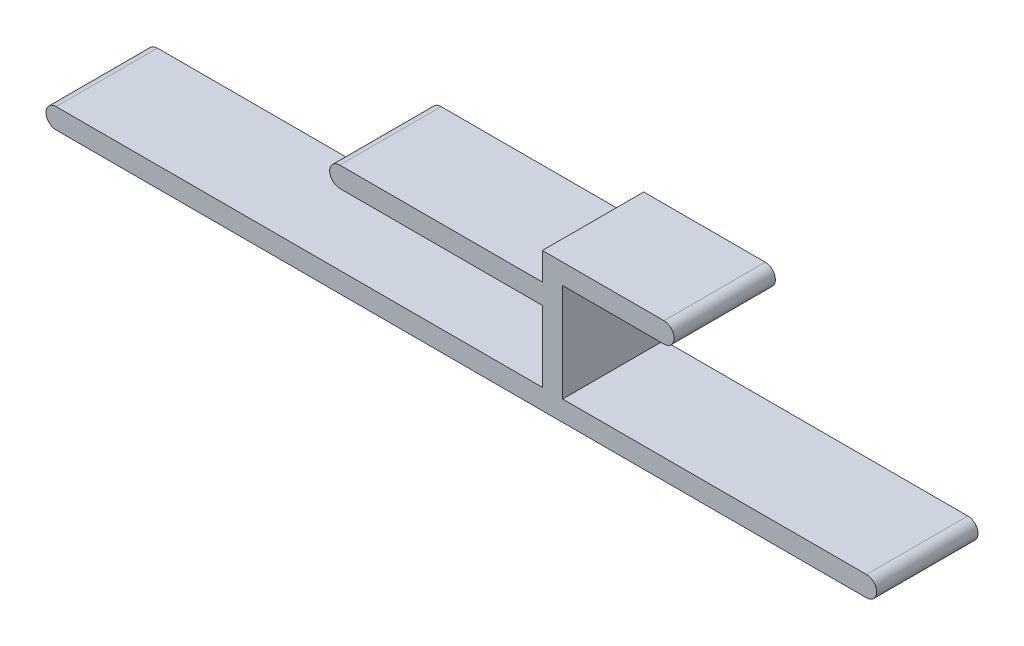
ISO-10303-21;
HEADER;
FILE_DESCRIPTION(('STEP AP214'),'2;1');
FILE_NAME('part.step','',(''),(''),'','','');
FILE_SCHEMA(('AUTOMOTIVE_DESIGN { 1 0 10303 214 1 1 1 1 }'));
ENDSEC;
DATA;
#1=APPLICATION_CONTEXT('core data for automotive mechanical design processes');
#2=APPLICATION_PROTOCOL_DEFINITION('international standard','automotive_design',2000,#1);
#3=PRODUCT_CONTEXT('',#1,'mechanical');
#4=PRODUCT('Part','Part','',(#3));
#5=PRODUCT_RELATED_PRODUCT_CATEGORY('part','',(#4));
#6=PRODUCT_DEFINITION_FORMATION('','',#4);
#7=PRODUCT_DEFINITION_CONTEXT('part definition',#1,'design');
#8=PRODUCT_DEFINITION('design','',#6,#7);
#9=PRODUCT_DEFINITION_SHAPE('','',#8);
#10=(LENGTH_UNIT() NAMED_UNIT(*) SI_UNIT(.MILLI.,.METRE.));
#11=(NAMED_UNIT(*) PLANE_ANGLE_UNIT() SI_UNIT($,.RADIAN.));
#12=(NAMED_UNIT(*) SI_UNIT($,.STERADIAN.) SOLID_ANGLE_UNIT());
#13=UNCERTAINTY_MEASURE_WITH_UNIT(LENGTH_MEASURE(1.E-05),#10,'distance_accuracy_value','');
#14=(GEOMETRIC_REPRESENTATION_CONTEXT(3) GLOBAL_UNCERTAINTY_ASSIGNED_CONTEXT((#13)) GLOBAL_UNIT_ASSIGNED_CONTEXT((#10,
#11,#12)) REPRESENTATION_CONTEXT('',''));
#15=CARTESIAN_POINT('',(0.,0.,0.));
#16=DIRECTION('',(0.,0.,1.));
#17=DIRECTION('',(1.,0.,0.));
#18=AXIS2_PLACEMENT_3D('',#15,#16,#17);
#19=CARTESIAN_POINT('',(-50.,-1.,10.));
#20=DIRECTION('',(0.,0.,-1.));
#21=DIRECTION('',(-1.,0.,0.));
#22=AXIS2_PLACEMENT_3D('',#19,#20,#21);
#23=CYLINDRICAL_SURFACE('',#22,1.);
#24=CARTESIAN_POINT('',(-50.,-1.,0.));
#25=DIRECTION('',(0.,0.,1.));
#26=DIRECTION('',(1.,0.,0.));
#27=AXIS2_PLACEMENT_3D('',#24,#25,#26);
#28=CIRCLE('',#27,1.);
#29=CARTESIAN_POINT('',(-50.,0.,0.));
#30=VERTEX_POINT('',#29);
#31=CARTESIAN_POINT('',(-50.,-2.,0.));
#32=VERTEX_POINT('',#31);
#33=EDGE_CURVE('E165',#30,#32,#28,.T.);
#34=ORIENTED_EDGE('',*,*,#33,.T.);
#35=DIRECTION('',(0.,0.,-1.));
#36=VECTOR('',#35,1.);
#37=CARTESIAN_POINT('',(-50.,-2.,10.));
#38=LINE('',#37,#36);
#39=CARTESIAN_POINT('',(-50.,-2.,10.));
#40=VERTEX_POINT('',#39);
#41=EDGE_CURVE('E11',#40,#32,#38,.T.);
#42=ORIENTED_EDGE('',*,*,#41,.F.);
#43=CARTESIAN_POINT('',(-50.,-1.,10.));
#44=DIRECTION('',(0.,0.,1.));
#45=DIRECTION('',(1.,0.,0.));
#46=AXIS2_PLACEMENT_3D('',#43,#44,#45);
#47=CIRCLE('',#46,1.);
#48=CARTESIAN_POINT('',(-50.,0.,10.));
#49=VERTEX_POINT('',#48);
#50=EDGE_CURVE('E191',#49,#40,#47,.T.);
#51=ORIENTED_EDGE('',*,*,#50,.F.);
#52=DIRECTION('',(0.,0.,-1.));
#53=VECTOR('',#52,1.);
#54=CARTESIAN_POINT('',(-50.,0.,10.));
#55=LINE('',#54,#53);
#56=EDGE_CURVE('E161',#49,#30,#55,.T.);
#57=ORIENTED_EDGE('',*,*,#56,.T.);
#58=EDGE_LOOP('',(#34,#42,#51,#57));
#59=FACE_BOUND('',#58,.T.);
#60=ADVANCED_FACE('F33',(#59),#23,.T.);
#61=CARTESIAN_POINT('',(-50.,-2.,10.));
#62=DIRECTION('',(0.,1.,0.));
#63=DIRECTION('',(0.,0.,1.));
#64=AXIS2_PLACEMENT_3D('',#61,#62,#63);
#65=PLANE('',#64);
#66=DIRECTION('',(1.,0.,0.));
#67=VECTOR('',#66,1.);
#68=CARTESIAN_POINT('',(-50.,-2.,0.));
#69=LINE('',#68,#67);
#70=CARTESIAN_POINT('',(30.,-2.,0.));
#71=VERTEX_POINT('',#70);
#72=EDGE_CURVE('E168',#32,#71,#69,.T.);
#73=ORIENTED_EDGE('',*,*,#72,.T.);
#74=DIRECTION('',(0.,0.,-1.));
#75=VECTOR('',#74,1.);
#76=CARTESIAN_POINT('',(30.,-2.,10.));
#77=LINE('',#76,#75);
#78=CARTESIAN_POINT('',(30.,-2.,10.));
#79=VERTEX_POINT('',#78);
#80=EDGE_CURVE('E41',#79,#71,#77,.T.);
#81=ORIENTED_EDGE('',*,*,#80,.F.);
#82=DIRECTION('',(1.,0.,0.));
#83=VECTOR('',#82,1.);
#84=CARTESIAN_POINT('',(-50.,-2.,10.));
#85=LINE('',#84,#83);
#86=EDGE_CURVE('E110',#40,#79,#85,.T.);
#87=ORIENTED_EDGE('',*,*,#86,.F.);
#88=ORIENTED_EDGE('',*,*,#41,.T.);
#89=EDGE_LOOP('',(#73,#81,#87,#88));
#90=FACE_BOUND('',#89,.T.);
#91=ADVANCED_FACE('F279',(#90),#65,.F.);
#92=CARTESIAN_POINT('',(30.,-0.999999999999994,10.));
#93=DIRECTION('',(0.,0.,-1.));
#94=DIRECTION('',(-1.,0.,0.));
#95=AXIS2_PLACEMENT_3D('',#92,#93,#94);
#96=CYLINDRICAL_SURFACE('',#95,1.00000000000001);
#97=CARTESIAN_POINT('',(30.,-0.999999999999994,0.));
#98=DIRECTION('',(0.,0.,1.));
#99=DIRECTION('',(-1.,0.,0.));
#100=AXIS2_PLACEMENT_3D('',#97,#98,#99);
#101=CIRCLE('',#100,1.00000000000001);
#102=CARTESIAN_POINT('',(30.,0.,0.));
#103=VERTEX_POINT('',#102);
#104=EDGE_CURVE('E170',#71,#103,#101,.T.);
#105=ORIENTED_EDGE('',*,*,#104,.T.);
#106=DIRECTION('',(0.,0.,-1.));
#107=VECTOR('',#106,1.);
#108=CARTESIAN_POINT('',(30.,0.,10.));
#109=LINE('',#108,#107);
#110=CARTESIAN_POINT('',(30.,0.,10.));
#111=VERTEX_POINT('',#110);
#112=EDGE_CURVE('E216',#111,#103,#109,.T.);
#113=ORIENTED_EDGE('',*,*,#112,.F.);
#114=CARTESIAN_POINT('',(30.,-0.999999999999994,10.));
#115=DIRECTION('',(0.,0.,1.));
#116=DIRECTION('',(-1.,0.,0.));
#117=AXIS2_PLACEMENT_3D('',#114,#115,#116);
#118=CIRCLE('',#117,1.00000000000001);
#119=EDGE_CURVE('E224',#79,#111,#118,.T.);
#120=ORIENTED_EDGE('',*,*,#119,.F.);
#121=ORIENTED_EDGE('',*,*,#80,.T.);
#122=EDGE_LOOP('',(#105,#113,#120,#121));
#123=FACE_BOUND('',#122,.T.);
#124=ADVANCED_FACE('F222',(#123),#96,.T.);
#125=CARTESIAN_POINT('',(0.,0.,10.));
#126=DIRECTION('',(0.,-1.,0.));
#127=DIRECTION('',(1.,0.,0.));
#128=AXIS2_PLACEMENT_3D('',#125,#126,#127);
#129=PLANE('',#128);
#130=DIRECTION('',(-1.,0.,0.));
#131=VECTOR('',#130,1.);
#132=CARTESIAN_POINT('',(0.,0.,0.));
#133=LINE('',#132,#131);
#134=CARTESIAN_POINT('',(0.,0.,0.));
#135=VERTEX_POINT('',#134);
#136=EDGE_CURVE('E172',#103,#135,#133,.T.);
#137=ORIENTED_EDGE('',*,*,#136,.T.);
#138=DIRECTION('',(0.,0.,-1.));
#139=VECTOR('',#138,1.);
#140=CARTESIAN_POINT('',(0.,0.,10.));
#141=LINE('',#140,#139);
#142=CARTESIAN_POINT('',(0.,0.,10.));
#143=VERTEX_POINT('',#142);
#144=EDGE_CURVE('E213',#143,#135,#141,.T.);
#145=ORIENTED_EDGE('',*,*,#144,.F.);
#146=DIRECTION('',(-1.,0.,0.));
#147=VECTOR('',#146,1.);
#148=CARTESIAN_POINT('',(0.,0.,10.));
#149=LINE('',#148,#147);
#150=EDGE_CURVE('E242',#111,#143,#149,.T.);
#151=ORIENTED_EDGE('',*,*,#150,.F.);
#152=ORIENTED_EDGE('',*,*,#112,.T.);
#153=EDGE_LOOP('',(#137,#145,#151,#152));
#154=FACE_BOUND('',#153,.T.);
#155=ADVANCED_FACE('F233',(#154),#129,.F.);
#156=CARTESIAN_POINT('',(0.,0.,10.));
#157=DIRECTION('',(-1.,0.,0.));
#158=DIRECTION('',(0.,-1.,0.));
#159=AXIS2_PLACEMENT_3D('',#156,#157,#158);
#160=PLANE('',#159);
#161=DIRECTION('',(0.,1.,0.));
#162=VECTOR('',#161,1.);
#163=CARTESIAN_POINT('',(0.,0.,0.));
#164=LINE('',#163,#162);
#165=CARTESIAN_POINT('',(0.,9.7,0.));
#166=VERTEX_POINT('',#165);
#167=EDGE_CURVE('E174',#135,#166,#164,.T.);
#168=ORIENTED_EDGE('',*,*,#167,.T.);
#169=DIRECTION('',(0.,0.,-1.));
#170=VECTOR('',#169,1.);
#171=CARTESIAN_POINT('',(0.,9.7,10.));
#172=LINE('',#171,#170);
#173=CARTESIAN_POINT('',(0.,9.7,10.));
#174=VERTEX_POINT('',#173);
#175=EDGE_CURVE('E210',#174,#166,#172,.T.);
#176=ORIENTED_EDGE('',*,*,#175,.F.);
#177=DIRECTION('',(0.,1.,0.));
#178=VECTOR('',#177,1.);
#179=CARTESIAN_POINT('',(0.,0.,10.));
#180=LINE('',#179,#178);
#181=EDGE_CURVE('E239',#143,#174,#180,.T.);
#182=ORIENTED_EDGE('',*,*,#181,.F.);
#183=ORIENTED_EDGE('',*,*,#144,.T.);
#184=EDGE_LOOP('',(#168,#176,#182,#183));
#185=FACE_BOUND('',#184,.T.);
#186=ADVANCED_FACE('F237',(#185),#160,.F.);
#187=CARTESIAN_POINT('',(0.,9.7,10.));
#188=DIRECTION('',(0.,1.,0.));
#189=DIRECTION('',(0.,0.,1.));
#190=AXIS2_PLACEMENT_3D('',#187,#188,#189);
#191=PLANE('',#190);
#192=DIRECTION('',(1.,0.,0.));
#193=VECTOR('',#192,1.);
#194=CARTESIAN_POINT('',(0.,9.7,0.));
#195=LINE('',#194,#193);
#196=CARTESIAN_POINT('',(10.,9.7,0.));
#197=VERTEX_POINT('',#196);
#198=EDGE_CURVE('E176',#166,#197,#195,.T.);
#199=ORIENTED_EDGE('',*,*,#198,.T.);
#200=DIRECTION('',(0.,0.,-1.));
#201=VECTOR('',#200,1.);
#202=CARTESIAN_POINT('',(10.,9.7,10.));
#203=LINE('',#202,#201);
#204=CARTESIAN_POINT('',(10.,9.7,10.));
#205=VERTEX_POINT('',#204);
#206=EDGE_CURVE('E207',#205,#197,#203,.T.);
#207=ORIENTED_EDGE('',*,*,#206,.F.);
#208=DIRECTION('',(1.,0.,0.));
#209=VECTOR('',#208,1.);
#210=CARTESIAN_POINT('',(0.,9.7,10.));
#211=LINE('',#210,#209);
#212=EDGE_CURVE('E241',#174,#205,#211,.T.);
#213=ORIENTED_EDGE('',*,*,#212,.F.);
#214=ORIENTED_EDGE('',*,*,#175,.T.);
#215=EDGE_LOOP('',(#199,#207,#213,#214));
#216=FACE_BOUND('',#215,.T.);
#217=ADVANCED_FACE('F292',(#216),#191,.F.);
#218=CARTESIAN_POINT('',(10.,10.7,10.));
#219=DIRECTION('',(0.,0.,-1.));
#220=DIRECTION('',(-1.,0.,0.));
#221=AXIS2_PLACEMENT_3D('',#218,#219,#220);
#222=CYLINDRICAL_SURFACE('',#221,1.);
#223=CARTESIAN_POINT('',(10.,10.7,0.));
#224=DIRECTION('',(0.,0.,1.));
#225=DIRECTION('',(1.,0.,0.));
#226=AXIS2_PLACEMENT_3D('',#223,#224,#225);
#227=CIRCLE('',#226,1.);
#228=CARTESIAN_POINT('',(10.,11.7,0.));
#229=VERTEX_POINT('',#228);
#230=EDGE_CURVE('E178',#197,#229,#227,.T.);
#231=ORIENTED_EDGE('',*,*,#230,.T.);
#232=DIRECTION('',(0.,0.,-1.));
#233=VECTOR('',#232,1.);
#234=CARTESIAN_POINT('',(10.,11.7,10.));
#235=LINE('',#234,#233);
#236=CARTESIAN_POINT('',(10.,11.7,10.));
#237=VERTEX_POINT('',#236);
#238=EDGE_CURVE('E204',#237,#229,#235,.T.);
#239=ORIENTED_EDGE('',*,*,#238,.F.);
#240=CARTESIAN_POINT('',(10.,10.7,10.));
#241=DIRECTION('',(0.,0.,1.));
#242=DIRECTION('',(1.,0.,0.));
#243=AXIS2_PLACEMENT_3D('',#240,#241,#242);
#244=CIRCLE('',#243,1.);
#245=EDGE_CURVE('E244',#205,#237,#244,.T.);
#246=ORIENTED_EDGE('',*,*,#245,.F.);
#247=ORIENTED_EDGE('',*,*,#206,.T.);
#248=EDGE_LOOP('',(#231,#239,#246,#247));
#249=FACE_BOUND('',#248,.T.);
#250=ADVANCED_FACE('F295',(#249),#222,.T.);
#251=CARTESIAN_POINT('',(-2.,11.7,10.));
#252=DIRECTION('',(0.,-1.,0.));
#253=DIRECTION('',(0.,0.,-1.));
#254=AXIS2_PLACEMENT_3D('',#251,#252,#253);
#255=PLANE('',#254);
#256=DIRECTION('',(-1.,0.,0.));
#257=VECTOR('',#256,1.);
#258=CARTESIAN_POINT('',(-2.,11.7,0.));
#259=LINE('',#258,#257);
#260=CARTESIAN_POINT('',(-2.,11.7,0.));
#261=VERTEX_POINT('',#260);
#262=EDGE_CURVE('E180',#229,#261,#259,.T.);
#263=ORIENTED_EDGE('',*,*,#262,.T.);
#264=DIRECTION('',(0.,0.,-1.));
#265=VECTOR('',#264,1.);
#266=CARTESIAN_POINT('',(-2.,11.7,10.));
#267=LINE('',#266,#265);
#268=CARTESIAN_POINT('',(-2.,11.7,10.));
#269=VERTEX_POINT('',#268);
#270=EDGE_CURVE('E201',#269,#261,#267,.T.);
#271=ORIENTED_EDGE('',*,*,#270,.F.);
#272=DIRECTION('',(-1.,0.,0.));
#273=VECTOR('',#272,1.);
#274=CARTESIAN_POINT('',(-2.,11.7,10.));
#275=LINE('',#274,#273);
#276=EDGE_CURVE('E250',#237,#269,#275,.T.);
#277=ORIENTED_EDGE('',*,*,#276,.F.);
#278=ORIENTED_EDGE('',*,*,#238,.T.);
#279=EDGE_LOOP('',(#263,#271,#277,#278));
#280=FACE_BOUND('',#279,.T.);
#281=ADVANCED_FACE('F299',(#280),#255,.F.);
#282=CARTESIAN_POINT('',(-2.,9.,10.));
#283=DIRECTION('',(1.,0.,0.));
#284=DIRECTION('',(0.,1.,0.));
#285=AXIS2_PLACEMENT_3D('',#282,#283,#284);
#286=PLANE('',#285);
#287=DIRECTION('',(0.,-1.,0.));
#288=VECTOR('',#287,1.);
#289=CARTESIAN_POINT('',(-2.,9.,0.));
#290=LINE('',#289,#288);
#291=CARTESIAN_POINT('',(-2.,9.,0.));
#292=VERTEX_POINT('',#291);
#293=EDGE_CURVE('E182',#261,#292,#290,.T.);
#294=ORIENTED_EDGE('',*,*,#293,.T.);
#295=DIRECTION('',(0.,0.,-1.));
#296=VECTOR('',#295,1.);
#297=CARTESIAN_POINT('',(-2.,9.,10.));
#298=LINE('',#297,#296);
#299=CARTESIAN_POINT('',(-2.,9.,10.));
#300=VERTEX_POINT('',#299);
#301=EDGE_CURVE('E198',#300,#292,#298,.T.);
#302=ORIENTED_EDGE('',*,*,#301,.F.);
#303=DIRECTION('',(0.,-1.,0.));
#304=VECTOR('',#303,1.);
#305=CARTESIAN_POINT('',(-2.,9.,10.));
#306=LINE('',#305,#304);
#307=EDGE_CURVE('E252',#269,#300,#306,.T.);
#308=ORIENTED_EDGE('',*,*,#307,.F.);
#309=ORIENTED_EDGE('',*,*,#270,.T.);
#310=EDGE_LOOP('',(#294,#302,#308,#309));
#311=FACE_BOUND('',#310,.T.);
#312=ADVANCED_FACE('F303',(#311),#286,.F.);
#313=CARTESIAN_POINT('',(-22.,9.,10.));
#314=DIRECTION('',(0.,-1.,0.));
#315=DIRECTION('',(0.,0.,-1.));
#316=AXIS2_PLACEMENT_3D('',#313,#314,#315);
#317=PLANE('',#316);
#318=DIRECTION('',(-1.,0.,0.));
#319=VECTOR('',#318,1.);
#320=CARTESIAN_POINT('',(-22.,9.,0.));
#321=LINE('',#320,#319);
#322=CARTESIAN_POINT('',(-22.,9.,0.));
#323=VERTEX_POINT('',#322);
#324=EDGE_CURVE('E184',#292,#323,#321,.T.);
#325=ORIENTED_EDGE('',*,*,#324,.T.);
#326=DIRECTION('',(0.,0.,-1.));
#327=VECTOR('',#326,1.);
#328=CARTESIAN_POINT('',(-22.,9.,10.));
#329=LINE('',#328,#327);
#330=CARTESIAN_POINT('',(-22.,9.,10.));
#331=VERTEX_POINT('',#330);
#332=EDGE_CURVE('E195',#331,#323,#329,.T.);
#333=ORIENTED_EDGE('',*,*,#332,.F.);
#334=DIRECTION('',(-1.,0.,0.));
#335=VECTOR('',#334,1.);
#336=CARTESIAN_POINT('',(-22.,9.,10.));
#337=LINE('',#336,#335);
#338=EDGE_CURVE('E254',#300,#331,#337,.T.);
#339=ORIENTED_EDGE('',*,*,#338,.F.);
#340=ORIENTED_EDGE('',*,*,#301,.T.);
#341=EDGE_LOOP('',(#325,#333,#339,#340));
#342=FACE_BOUND('',#341,.T.);
#343=ADVANCED_FACE('F260',(#342),#317,.F.);
#344=CARTESIAN_POINT('',(-22.,8.,10.));
#345=DIRECTION('',(0.,0.,-1.));
#346=DIRECTION('',(-1.,0.,0.));
#347=AXIS2_PLACEMENT_3D('',#344,#345,#346);
#348=CYLINDRICAL_SURFACE('',#347,1.);
#349=CARTESIAN_POINT('',(-22.,8.,0.));
#350=DIRECTION('',(0.,0.,1.));
#351=DIRECTION('',(-1.,0.,0.));
#352=AXIS2_PLACEMENT_3D('',#349,#350,#351);
#353=CIRCLE('',#352,1.);
#354=CARTESIAN_POINT('',(-22.,7.,0.));
#355=VERTEX_POINT('',#354);
#356=EDGE_CURVE('E186',#323,#355,#353,.T.);
#357=ORIENTED_EDGE('',*,*,#356,.T.);
#358=DIRECTION('',(0.,0.,-1.));
#359=VECTOR('',#358,1.);
#360=CARTESIAN_POINT('',(-22.,7.,10.));
#361=LINE('',#360,#359);
#362=CARTESIAN_POINT('',(-22.,7.,10.));
#363=VERTEX_POINT('',#362);
#364=EDGE_CURVE('E156',#363,#355,#361,.T.);
#365=ORIENTED_EDGE('',*,*,#364,.F.);
#366=CARTESIAN_POINT('',(-22.,8.,10.));
#367=DIRECTION('',(0.,0.,1.));
#368=DIRECTION('',(-1.,0.,0.));
#369=AXIS2_PLACEMENT_3D('',#366,#367,#368);
#370=CIRCLE('',#369,1.);
#371=EDGE_CURVE('E147',#331,#363,#370,.T.);
#372=ORIENTED_EDGE('',*,*,#371,.F.);
#373=ORIENTED_EDGE('',*,*,#332,.T.);
#374=EDGE_LOOP('',(#357,#365,#372,#373));
#375=FACE_BOUND('',#374,.T.);
#376=ADVANCED_FACE('F264',(#375),#348,.T.);
#377=CARTESIAN_POINT('',(-22.,7.,10.));
#378=DIRECTION('',(0.,1.,0.));
#379=DIRECTION('',(0.,0.,1.));
#380=AXIS2_PLACEMENT_3D('',#377,#378,#379);
#381=PLANE('',#380);
#382=DIRECTION('',(1.,0.,0.));
#383=VECTOR('',#382,1.);
#384=CARTESIAN_POINT('',(-22.,7.,0.));
#385=LINE('',#384,#383);
#386=CARTESIAN_POINT('',(-2.,7.,0.));
#387=VERTEX_POINT('',#386);
#388=EDGE_CURVE('E155',#355,#387,#385,.T.);
#389=ORIENTED_EDGE('',*,*,#388,.T.);
#390=DIRECTION('',(0.,0.,-1.));
#391=VECTOR('',#390,1.);
#392=CARTESIAN_POINT('',(-2.,7.,10.));
#393=LINE('',#392,#391);
#394=CARTESIAN_POINT('',(-2.,7.,10.));
#395=VERTEX_POINT('',#394);
#396=EDGE_CURVE('E152',#395,#387,#393,.T.);
#397=ORIENTED_EDGE('',*,*,#396,.F.);
#398=DIRECTION('',(1.,0.,0.));
#399=VECTOR('',#398,1.);
#400=CARTESIAN_POINT('',(-22.,7.,10.));
#401=LINE('',#400,#399);
#402=EDGE_CURVE('E141',#363,#395,#401,.T.);
#403=ORIENTED_EDGE('',*,*,#402,.F.);
#404=ORIENTED_EDGE('',*,*,#364,.T.);
#405=EDGE_LOOP('',(#389,#397,#403,#404));
#406=FACE_BOUND('',#405,.T.);
#407=ADVANCED_FACE('F153',(#406),#381,.F.);
#408=CARTESIAN_POINT('',(-2.,0.,10.));
#409=DIRECTION('',(1.,0.,0.));
#410=DIRECTION('',(0.,1.,0.));
#411=AXIS2_PLACEMENT_3D('',#408,#409,#410);
#412=PLANE('',#411);
#413=DIRECTION('',(0.,-1.,0.));
#414=VECTOR('',#413,1.);
#415=CARTESIAN_POINT('',(-2.,0.,0.));
#416=LINE('',#415,#414);
#417=CARTESIAN_POINT('',(-2.,0.,0.));
#418=VERTEX_POINT('',#417);
#419=EDGE_CURVE('E96',#387,#418,#416,.T.);
#420=ORIENTED_EDGE('',*,*,#419,.T.);
#421=DIRECTION('',(0.,0.,-1.));
#422=VECTOR('',#421,1.);
#423=CARTESIAN_POINT('',(-2.,0.,10.));
#424=LINE('',#423,#422);
#425=CARTESIAN_POINT('',(-2.,0.,10.));
#426=VERTEX_POINT('',#425);
#427=EDGE_CURVE('E157',#426,#418,#424,.T.);
#428=ORIENTED_EDGE('',*,*,#427,.F.);
#429=DIRECTION('',(0.,-1.,0.));
#430=VECTOR('',#429,1.);
#431=CARTESIAN_POINT('',(-2.,0.,10.));
#432=LINE('',#431,#430);
#433=EDGE_CURVE('E145',#395,#426,#432,.T.);
#434=ORIENTED_EDGE('',*,*,#433,.F.);
#435=ORIENTED_EDGE('',*,*,#396,.T.);
#436=EDGE_LOOP('',(#420,#428,#434,#435));
#437=FACE_BOUND('',#436,.T.);
#438=ADVANCED_FACE('F159',(#437),#412,.F.);
#439=CARTESIAN_POINT('',(-50.,0.,10.));
#440=DIRECTION('',(0.,-1.,0.));
#441=DIRECTION('',(0.,0.,-1.));
#442=AXIS2_PLACEMENT_3D('',#439,#440,#441);
#443=PLANE('',#442);
#444=DIRECTION('',(-1.,0.,0.));
#445=VECTOR('',#444,1.);
#446=CARTESIAN_POINT('',(-50.,0.,0.));
#447=LINE('',#446,#445);
#448=EDGE_CURVE('E102',#418,#30,#447,.T.);
#449=ORIENTED_EDGE('',*,*,#448,.T.);
#450=ORIENTED_EDGE('',*,*,#56,.F.);
#451=DIRECTION('',(-1.,0.,0.));
#452=VECTOR('',#451,1.);
#453=CARTESIAN_POINT('',(-50.,0.,10.));
#454=LINE('',#453,#452);
#455=EDGE_CURVE('E49',#426,#49,#454,.T.);
#456=ORIENTED_EDGE('',*,*,#455,.F.);
#457=ORIENTED_EDGE('',*,*,#427,.T.);
#458=EDGE_LOOP('',(#449,#450,#456,#457));
#459=FACE_BOUND('',#458,.T.);
#460=ADVANCED_FACE('F268',(#459),#443,.F.);
#461=CARTESIAN_POINT('',(-50.,-1.,10.));
#462=DIRECTION('',(0.,0.,1.));
#463=DIRECTION('',(1.,0.,0.));
#464=AXIS2_PLACEMENT_3D('',#461,#462,#463);
#465=PLANE('',#464);
#466=ORIENTED_EDGE('',*,*,#50,.T.);
#467=ORIENTED_EDGE('',*,*,#86,.T.);
#468=ORIENTED_EDGE('',*,*,#119,.T.);
#469=ORIENTED_EDGE('',*,*,#150,.T.);
#470=ORIENTED_EDGE('',*,*,#181,.T.);
#471=ORIENTED_EDGE('',*,*,#212,.T.);
#472=ORIENTED_EDGE('',*,*,#245,.T.);
#473=ORIENTED_EDGE('',*,*,#276,.T.);
#474=ORIENTED_EDGE('',*,*,#307,.T.);
#475=ORIENTED_EDGE('',*,*,#338,.T.);
#476=ORIENTED_EDGE('',*,*,#371,.T.);
#477=ORIENTED_EDGE('',*,*,#402,.T.);
#478=ORIENTED_EDGE('',*,*,#433,.T.);
#479=ORIENTED_EDGE('',*,*,#455,.T.);
#480=EDGE_LOOP('',(#466,#467,#468,#469,#470,#471,#472,#473,#474,#475,#476,#477,#478,#479));
#481=FACE_BOUND('',#480,.T.);
#482=ADVANCED_FACE('F143',(#481),#465,.T.);
#483=CARTESIAN_POINT('',(-50.,-1.,0.));
#484=DIRECTION('',(0.,0.,1.));
#485=DIRECTION('',(1.,0.,0.));
#486=AXIS2_PLACEMENT_3D('',#483,#484,#485);
#487=PLANE('',#486);
#488=ORIENTED_EDGE('',*,*,#33,.F.);
#489=ORIENTED_EDGE('',*,*,#448,.F.);
#490=ORIENTED_EDGE('',*,*,#419,.F.);
#491=ORIENTED_EDGE('',*,*,#388,.F.);
#492=ORIENTED_EDGE('',*,*,#356,.F.);
#493=ORIENTED_EDGE('',*,*,#324,.F.);
#494=ORIENTED_EDGE('',*,*,#293,.F.);
#495=ORIENTED_EDGE('',*,*,#262,.F.);
#496=ORIENTED_EDGE('',*,*,#230,.F.);
#497=ORIENTED_EDGE('',*,*,#198,.F.);
#498=ORIENTED_EDGE('',*,*,#167,.F.);
#499=ORIENTED_EDGE('',*,*,#136,.F.);
#500=ORIENTED_EDGE('',*,*,#104,.F.);
#501=ORIENTED_EDGE('',*,*,#72,.F.);
#502=EDGE_LOOP('',(#488,#489,#490,#491,#492,#493,#494,#495,#496,#497,#498,#499,#500,#501));
#503=FACE_BOUND('',#502,.T.);
#504=ADVANCED_FACE('F228',(#503),#487,.F.);
#505=CLOSED_SHELL('',(#60,#91,#124,#155,#186,#217,#250,#281,#312,#343,#376,#407,#438,#460,#482,#504));
#506=MANIFOLD_SOLID_BREP('B2',#505);
#507=ADVANCED_BREP_SHAPE_REPRESENTATION('',(#18,#506),#14);
#508=SHAPE_DEFINITION_REPRESENTATION(#9,#507);
ENDSEC;
END-ISO-10303-21;
